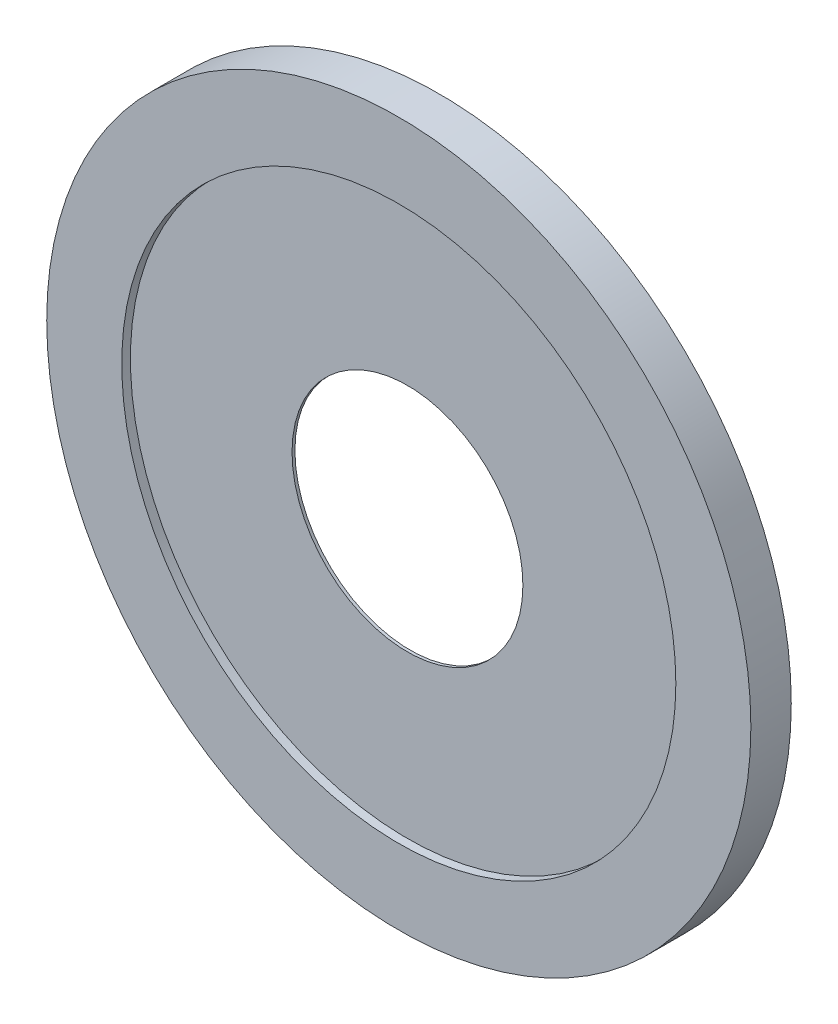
from build123d import *

# Parameters (mm, degrees)
SKETCH1_R           = 387.35
BOSS_EXTRUDE1_DEPTH = 44.45
SKETCH2_R           = 304.8
CUT_EXTRUDE1_DEPTH  = 9.525
CUT_EXTRUDE2_START  = -31.75
SKETCH3_R           = 304.8
CUT_EXTRUDE2_DEPTH  = 31.75
CUT_EXTRUDE3_REACH  = 550.908
SKETCH4_R           = 127


with BuildPart() as part:
    # Sketch1 → Boss-Extrude1 (new body)
    with BuildSketch(Plane.XY):
        Circle(SKETCH1_R)
    extrude(amount=BOSS_EXTRUDE1_DEPTH)

    # Sketch2 → Cut-Extrude1 (cut)
    with BuildSketch(Plane.XY.offset(44.45)):
        Circle(SKETCH2_R)
    extrude(amount=-CUT_EXTRUDE1_DEPTH, mode=Mode.SUBTRACT)

    # Sketch3 → Cut-Extrude2 (cut)
    with BuildSketch(Plane(origin=(0, 0, 0), x_dir=(-1, 0, 0), z_dir=(0, 0, -1)).offset(CUT_EXTRUDE2_START)):
        with Locations(Location((0, 0, 0), (0, 0, 180))):
            Circle(SKETCH3_R)
    extrude(amount=CUT_EXTRUDE2_DEPTH, mode=Mode.SUBTRACT)

    # Sketch4 → Cut-Extrude3 (cut, up to next)
    with BuildSketch(Plane.XY.offset(34.925), mode=Mode.PRIVATE) as cut_extrude3_sk1:
        Circle(SKETCH4_R)
    cut_extrude3_tool1 = extrude(cut_extrude3_sk1.sketch, amount=-CUT_EXTRUDE3_REACH, mode=Mode.PRIVATE) & part.part
    add(cut_extrude3_tool1.solids().sort_by_distance((0, 0, 34.925))[0], mode=Mode.SUBTRACT)


solid = part.part
